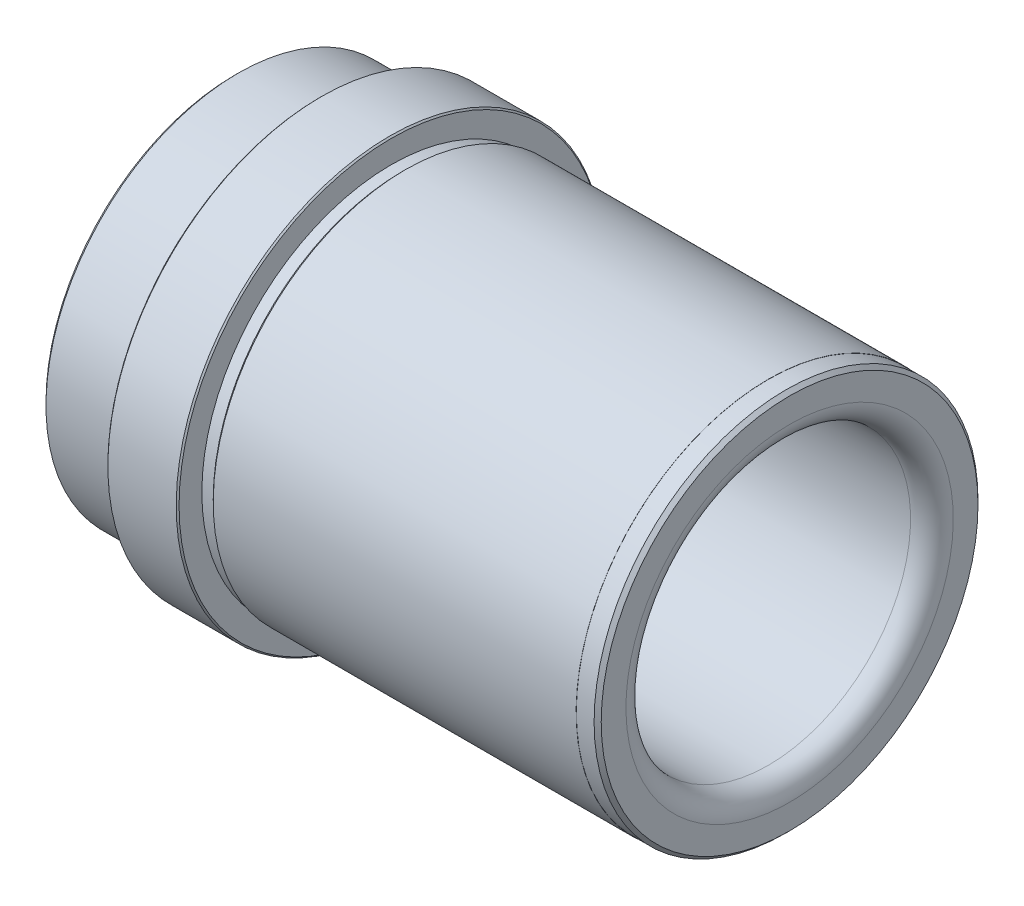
ISO-10303-21;
HEADER;
FILE_DESCRIPTION(('STEP AP214'),'2;1');
FILE_NAME('part.step','',(''),(''),'','','');
FILE_SCHEMA(('AUTOMOTIVE_DESIGN { 1 0 10303 214 1 1 1 1 }'));
ENDSEC;
DATA;
#1=APPLICATION_CONTEXT('core data for automotive mechanical design processes');
#2=APPLICATION_PROTOCOL_DEFINITION('international standard','automotive_design',2000,#1);
#3=PRODUCT_CONTEXT('',#1,'mechanical');
#4=PRODUCT('Part','Part','',(#3));
#5=PRODUCT_RELATED_PRODUCT_CATEGORY('part','',(#4));
#6=PRODUCT_DEFINITION_FORMATION('','',#4);
#7=PRODUCT_DEFINITION_CONTEXT('part definition',#1,'design');
#8=PRODUCT_DEFINITION('design','',#6,#7);
#9=PRODUCT_DEFINITION_SHAPE('','',#8);
#10=(LENGTH_UNIT() NAMED_UNIT(*) SI_UNIT(.MILLI.,.METRE.));
#11=(NAMED_UNIT(*) PLANE_ANGLE_UNIT() SI_UNIT($,.RADIAN.));
#12=(NAMED_UNIT(*) SI_UNIT($,.STERADIAN.) SOLID_ANGLE_UNIT());
#13=UNCERTAINTY_MEASURE_WITH_UNIT(LENGTH_MEASURE(1.E-05),#10,'distance_accuracy_value','');
#14=(GEOMETRIC_REPRESENTATION_CONTEXT(3) GLOBAL_UNCERTAINTY_ASSIGNED_CONTEXT((#13)) GLOBAL_UNIT_ASSIGNED_CONTEXT((#10,
#11,#12)) REPRESENTATION_CONTEXT('',''));
#15=CARTESIAN_POINT('',(0.,0.,0.));
#16=DIRECTION('',(0.,0.,1.));
#17=DIRECTION('',(1.,0.,0.));
#18=AXIS2_PLACEMENT_3D('',#15,#16,#17);
#19=CARTESIAN_POINT('',(39.,0.,0.));
#20=DIRECTION('',(1.,0.,0.));
#21=DIRECTION('',(0.,1.,0.));
#22=AXIS2_PLACEMENT_3D('',#19,#20,#21);
#23=CYLINDRICAL_SURFACE('',#22,26.6);
#24=CARTESIAN_POINT('',(-17.,0.,0.));
#25=DIRECTION('',(1.,0.,0.));
#26=DIRECTION('',(0.,1.,0.));
#27=AXIS2_PLACEMENT_3D('',#24,#25,#26);
#28=CIRCLE('',#27,26.6);
#29=CARTESIAN_POINT('',(-17.,26.6,0.));
#30=VERTEX_POINT('',#29);
#31=EDGE_CURVE('E73',#30,#30,#28,.T.);
#32=ORIENTED_EDGE('',*,*,#31,.T.);
#33=EDGE_LOOP('',(#32));
#34=FACE_BOUND('',#33,.T.);
#35=CARTESIAN_POINT('',(-15.4,0.,0.));
#36=DIRECTION('',(1.,0.,0.));
#37=DIRECTION('',(0.,1.,0.));
#38=AXIS2_PLACEMENT_3D('',#35,#36,#37);
#39=CIRCLE('',#38,26.6);
#40=CARTESIAN_POINT('',(-15.4,26.6,0.));
#41=VERTEX_POINT('',#40);
#42=EDGE_CURVE('E94',#41,#41,#39,.T.);
#43=ORIENTED_EDGE('',*,*,#42,.F.);
#44=EDGE_LOOP('',(#43));
#45=FACE_BOUND('',#44,.T.);
#46=ADVANCED_FACE('F29',(#34,#45),#23,.T.);
#47=CARTESIAN_POINT('',(-17.,30.,0.));
#48=DIRECTION('',(1.,0.,0.));
#49=DIRECTION('',(0.,1.,0.));
#50=AXIS2_PLACEMENT_3D('',#47,#48,#49);
#51=PLANE('',#50);
#52=CARTESIAN_POINT('',(-17.,0.,0.));
#53=DIRECTION('',(1.,0.,0.));
#54=DIRECTION('',(0.,1.,0.));
#55=AXIS2_PLACEMENT_3D('',#52,#53,#54);
#56=CIRCLE('',#55,29.8);
#57=CARTESIAN_POINT('',(-17.,29.8,0.));
#58=VERTEX_POINT('',#57);
#59=EDGE_CURVE('E49',#58,#58,#56,.T.);
#60=ORIENTED_EDGE('',*,*,#59,.T.);
#61=EDGE_LOOP('',(#60));
#62=FACE_BOUND('',#61,.T.);
#63=ORIENTED_EDGE('',*,*,#31,.F.);
#64=EDGE_LOOP('',(#63));
#65=FACE_BOUND('',#64,.T.);
#66=ADVANCED_FACE('F102',(#62,#65),#51,.T.);
#67=CARTESIAN_POINT('',(39.,0.,0.));
#68=DIRECTION('',(1.,0.,0.));
#69=DIRECTION('',(0.,1.,0.));
#70=AXIS2_PLACEMENT_3D('',#67,#68,#69);
#71=CYLINDRICAL_SURFACE('',#70,30.);
#72=CARTESIAN_POINT('',(-26.8,0.,0.));
#73=DIRECTION('',(-1.,0.,0.));
#74=DIRECTION('',(0.,-1.,0.));
#75=AXIS2_PLACEMENT_3D('',#72,#73,#74);
#76=CIRCLE('',#75,30.);
#77=CARTESIAN_POINT('',(-26.8,-30.,0.));
#78=VERTEX_POINT('',#77);
#79=EDGE_CURVE('E55',#78,#78,#76,.F.);
#80=ORIENTED_EDGE('',*,*,#79,.T.);
#81=EDGE_LOOP('',(#80));
#82=FACE_BOUND('',#81,.T.);
#83=CARTESIAN_POINT('',(-17.2,0.,0.));
#84=DIRECTION('',(1.,0.,0.));
#85=DIRECTION('',(0.,1.,0.));
#86=AXIS2_PLACEMENT_3D('',#83,#84,#85);
#87=CIRCLE('',#86,30.);
#88=CARTESIAN_POINT('',(-17.2,30.,0.));
#89=VERTEX_POINT('',#88);
#90=EDGE_CURVE('E58',#89,#89,#87,.F.);
#91=ORIENTED_EDGE('',*,*,#90,.T.);
#92=EDGE_LOOP('',(#91));
#93=FACE_BOUND('',#92,.T.);
#94=ADVANCED_FACE('F108',(#82,#93),#71,.T.);
#95=CARTESIAN_POINT('',(-27.,26.6,0.));
#96=DIRECTION('',(-1.,0.,0.));
#97=DIRECTION('',(0.,-1.,0.));
#98=AXIS2_PLACEMENT_3D('',#95,#96,#97);
#99=PLANE('',#98);
#100=CARTESIAN_POINT('',(-27.,0.,0.));
#101=DIRECTION('',(-1.,0.,0.));
#102=DIRECTION('',(0.,-1.,0.));
#103=AXIS2_PLACEMENT_3D('',#100,#101,#102);
#104=CIRCLE('',#103,29.8);
#105=CARTESIAN_POINT('',(-27.,-29.8,0.));
#106=VERTEX_POINT('',#105);
#107=EDGE_CURVE('E52',#106,#106,#104,.T.);
#108=ORIENTED_EDGE('',*,*,#107,.T.);
#109=EDGE_LOOP('',(#108));
#110=FACE_BOUND('',#109,.T.);
#111=CARTESIAN_POINT('',(-27.,0.,0.));
#112=DIRECTION('',(1.,0.,0.));
#113=DIRECTION('',(0.,1.,0.));
#114=AXIS2_PLACEMENT_3D('',#111,#112,#113);
#115=CIRCLE('',#114,26.6);
#116=CARTESIAN_POINT('',(-27.,26.6,0.));
#117=VERTEX_POINT('',#116);
#118=EDGE_CURVE('E76',#117,#117,#115,.T.);
#119=ORIENTED_EDGE('',*,*,#118,.T.);
#120=EDGE_LOOP('',(#119));
#121=FACE_BOUND('',#120,.T.);
#122=ADVANCED_FACE('F178',(#110,#121),#99,.T.);
#123=CARTESIAN_POINT('',(39.,0.,0.));
#124=DIRECTION('',(1.,0.,0.));
#125=DIRECTION('',(0.,1.,0.));
#126=AXIS2_PLACEMENT_3D('',#123,#124,#125);
#127=CYLINDRICAL_SURFACE('',#126,26.6);
#128=CARTESIAN_POINT('',(-28.6,0.,0.));
#129=DIRECTION('',(1.,0.,0.));
#130=DIRECTION('',(0.,1.,0.));
#131=AXIS2_PLACEMENT_3D('',#128,#129,#130);
#132=CIRCLE('',#131,26.6);
#133=CARTESIAN_POINT('',(-28.6,26.6,0.));
#134=VERTEX_POINT('',#133);
#135=EDGE_CURVE('E79',#134,#134,#132,.T.);
#136=ORIENTED_EDGE('',*,*,#135,.T.);
#137=EDGE_LOOP('',(#136));
#138=FACE_BOUND('',#137,.T.);
#139=ORIENTED_EDGE('',*,*,#118,.F.);
#140=EDGE_LOOP('',(#139));
#141=FACE_BOUND('',#140,.T.);
#142=ADVANCED_FACE('F174',(#138,#141),#127,.T.);
#143=CARTESIAN_POINT('',(-28.6,0.,0.));
#144=DIRECTION('',(-1.,0.,0.));
#145=DIRECTION('',(0.,-1.,0.));
#146=AXIS2_PLACEMENT_3D('',#143,#144,#145);
#147=CONICAL_SURFACE('',#146,26.6,0.785398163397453);
#148=CARTESIAN_POINT('',(-29.,0.,0.));
#149=DIRECTION('',(1.,0.,0.));
#150=DIRECTION('',(0.,1.,0.));
#151=AXIS2_PLACEMENT_3D('',#148,#149,#150);
#152=CIRCLE('',#151,27.);
#153=CARTESIAN_POINT('',(-29.,27.,0.));
#154=VERTEX_POINT('',#153);
#155=EDGE_CURVE('E82',#154,#154,#152,.T.);
#156=ORIENTED_EDGE('',*,*,#155,.T.);
#157=EDGE_LOOP('',(#156));
#158=FACE_BOUND('',#157,.T.);
#159=ORIENTED_EDGE('',*,*,#135,.F.);
#160=EDGE_LOOP('',(#159));
#161=FACE_BOUND('',#160,.T.);
#162=ADVANCED_FACE('F171',(#158,#161),#147,.T.);
#163=CARTESIAN_POINT('',(39.,0.,0.));
#164=DIRECTION('',(1.,0.,0.));
#165=DIRECTION('',(0.,1.,0.));
#166=AXIS2_PLACEMENT_3D('',#163,#164,#165);
#167=CYLINDRICAL_SURFACE('',#166,27.);
#168=CARTESIAN_POINT('',(-38.5,0.,0.));
#169=DIRECTION('',(-1.,0.,0.));
#170=DIRECTION('',(0.,-1.,0.));
#171=AXIS2_PLACEMENT_3D('',#168,#169,#170);
#172=CIRCLE('',#171,27.);
#173=CARTESIAN_POINT('',(-38.5,-27.,0.));
#174=VERTEX_POINT('',#173);
#175=EDGE_CURVE('E11',#174,#174,#172,.F.);
#176=ORIENTED_EDGE('',*,*,#175,.T.);
#177=EDGE_LOOP('',(#176));
#178=FACE_BOUND('',#177,.T.);
#179=ORIENTED_EDGE('',*,*,#155,.F.);
#180=EDGE_LOOP('',(#179));
#181=FACE_BOUND('',#180,.T.);
#182=ADVANCED_FACE('F168',(#178,#181),#167,.T.);
#183=CARTESIAN_POINT('',(-39.,27.,0.));
#184=DIRECTION('',(-1.,0.,0.));
#185=DIRECTION('',(0.,-1.,0.));
#186=AXIS2_PLACEMENT_3D('',#183,#184,#185);
#187=PLANE('',#186);
#188=CARTESIAN_POINT('',(-39.,0.,0.));
#189=DIRECTION('',(-1.,0.,0.));
#190=DIRECTION('',(0.,-1.,0.));
#191=AXIS2_PLACEMENT_3D('',#188,#189,#190);
#192=CIRCLE('',#191,20.5000000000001);
#193=CARTESIAN_POINT('',(-39.,-20.5000000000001,0.));
#194=VERTEX_POINT('',#193);
#195=EDGE_CURVE('E36',#194,#194,#192,.F.);
#196=ORIENTED_EDGE('',*,*,#195,.T.);
#197=EDGE_LOOP('',(#196));
#198=FACE_BOUND('',#197,.T.);
#199=CARTESIAN_POINT('',(-39.,0.,0.));
#200=DIRECTION('',(-1.,0.,0.));
#201=DIRECTION('',(0.,-1.,0.));
#202=AXIS2_PLACEMENT_3D('',#199,#200,#201);
#203=CIRCLE('',#202,26.5);
#204=CARTESIAN_POINT('',(-39.,-26.5,0.));
#205=VERTEX_POINT('',#204);
#206=EDGE_CURVE('E40',#205,#205,#203,.T.);
#207=ORIENTED_EDGE('',*,*,#206,.T.);
#208=EDGE_LOOP('',(#207));
#209=FACE_BOUND('',#208,.T.);
#210=ADVANCED_FACE('F164',(#198,#209),#187,.T.);
#211=CARTESIAN_POINT('',(39.,26.975,0.));
#212=DIRECTION('',(1.,0.,0.));
#213=DIRECTION('',(0.,1.,0.));
#214=AXIS2_PLACEMENT_3D('',#211,#212,#213);
#215=PLANE('',#214);
#216=CARTESIAN_POINT('',(39.,0.,0.));
#217=DIRECTION('',(1.,0.,0.));
#218=DIRECTION('',(0.,1.,0.));
#219=AXIS2_PLACEMENT_3D('',#216,#217,#218);
#220=CIRCLE('',#219,26.475);
#221=CARTESIAN_POINT('',(39.,26.475,0.));
#222=VERTEX_POINT('',#221);
#223=EDGE_CURVE('E64',#222,#222,#220,.T.);
#224=ORIENTED_EDGE('',*,*,#223,.T.);
#225=EDGE_LOOP('',(#224));
#226=FACE_BOUND('',#225,.T.);
#227=CARTESIAN_POINT('',(39.,0.,0.));
#228=DIRECTION('',(1.,0.,0.));
#229=DIRECTION('',(0.,1.,0.));
#230=AXIS2_PLACEMENT_3D('',#227,#228,#229);
#231=CIRCLE('',#230,23.);
#232=CARTESIAN_POINT('',(39.,23.,0.));
#233=VERTEX_POINT('',#232);
#234=EDGE_CURVE('E67',#233,#233,#231,.F.);
#235=ORIENTED_EDGE('',*,*,#234,.T.);
#236=EDGE_LOOP('',(#235));
#237=FACE_BOUND('',#236,.T.);
#238=ADVANCED_FACE('F160',(#226,#237),#215,.T.);
#239=CARTESIAN_POINT('',(39.,0.,0.));
#240=DIRECTION('',(1.,0.,0.));
#241=DIRECTION('',(0.,1.,0.));
#242=AXIS2_PLACEMENT_3D('',#239,#240,#241);
#243=CYLINDRICAL_SURFACE('',#242,26.975);
#244=CARTESIAN_POINT('',(38.5,0.,0.));
#245=DIRECTION('',(1.,0.,0.));
#246=DIRECTION('',(0.,1.,0.));
#247=AXIS2_PLACEMENT_3D('',#244,#245,#246);
#248=CIRCLE('',#247,26.975);
#249=CARTESIAN_POINT('',(38.5,26.975,0.));
#250=VERTEX_POINT('',#249);
#251=EDGE_CURVE('E61',#250,#250,#248,.F.);
#252=ORIENTED_EDGE('',*,*,#251,.T.);
#253=EDGE_LOOP('',(#252));
#254=FACE_BOUND('',#253,.T.);
#255=CARTESIAN_POINT('',(36.,0.,0.));
#256=DIRECTION('',(1.,0.,0.));
#257=DIRECTION('',(0.,1.,0.));
#258=AXIS2_PLACEMENT_3D('',#255,#256,#257);
#259=CIRCLE('',#258,26.975);
#260=CARTESIAN_POINT('',(36.,26.975,0.));
#261=VERTEX_POINT('',#260);
#262=EDGE_CURVE('E85',#261,#261,#259,.T.);
#263=ORIENTED_EDGE('',*,*,#262,.T.);
#264=EDGE_LOOP('',(#263));
#265=FACE_BOUND('',#264,.T.);
#266=ADVANCED_FACE('F156',(#254,#265),#243,.T.);
#267=CARTESIAN_POINT('',(36.,26.975,0.));
#268=DIRECTION('',(1.,0.,0.));
#269=DIRECTION('',(0.,1.,0.));
#270=AXIS2_PLACEMENT_3D('',#267,#268,#269);
#271=PLANE('',#270);
#272=CARTESIAN_POINT('',(36.,0.,0.));
#273=DIRECTION('',(1.,0.,0.));
#274=DIRECTION('',(0.,1.,0.));
#275=AXIS2_PLACEMENT_3D('',#272,#273,#274);
#276=CIRCLE('',#275,27.);
#277=CARTESIAN_POINT('',(36.,27.,0.));
#278=VERTEX_POINT('',#277);
#279=EDGE_CURVE('E88',#278,#278,#276,.T.);
#280=ORIENTED_EDGE('',*,*,#279,.T.);
#281=EDGE_LOOP('',(#280));
#282=FACE_BOUND('',#281,.T.);
#283=ORIENTED_EDGE('',*,*,#262,.F.);
#284=EDGE_LOOP('',(#283));
#285=FACE_BOUND('',#284,.T.);
#286=ADVANCED_FACE('F152',(#282,#285),#271,.T.);
#287=CARTESIAN_POINT('',(39.,0.,0.));
#288=DIRECTION('',(1.,0.,0.));
#289=DIRECTION('',(0.,1.,0.));
#290=AXIS2_PLACEMENT_3D('',#287,#288,#289);
#291=CYLINDRICAL_SURFACE('',#290,27.);
#292=CARTESIAN_POINT('',(-15.,0.,0.));
#293=DIRECTION('',(1.,0.,0.));
#294=DIRECTION('',(0.,1.,0.));
#295=AXIS2_PLACEMENT_3D('',#292,#293,#294);
#296=CIRCLE('',#295,27.);
#297=CARTESIAN_POINT('',(-15.,27.,0.));
#298=VERTEX_POINT('',#297);
#299=EDGE_CURVE('E91',#298,#298,#296,.T.);
#300=ORIENTED_EDGE('',*,*,#299,.T.);
#301=EDGE_LOOP('',(#300));
#302=FACE_BOUND('',#301,.T.);
#303=ORIENTED_EDGE('',*,*,#279,.F.);
#304=EDGE_LOOP('',(#303));
#305=FACE_BOUND('',#304,.T.);
#306=ADVANCED_FACE('F147',(#302,#305),#291,.T.);
#307=CARTESIAN_POINT('',(-15.,0.,0.));
#308=DIRECTION('',(1.,0.,0.));
#309=DIRECTION('',(0.,1.,0.));
#310=AXIS2_PLACEMENT_3D('',#307,#308,#309);
#311=CONICAL_SURFACE('',#310,27.,0.785398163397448);
#312=ORIENTED_EDGE('',*,*,#42,.T.);
#313=EDGE_LOOP('',(#312));
#314=FACE_BOUND('',#313,.T.);
#315=ORIENTED_EDGE('',*,*,#299,.F.);
#316=EDGE_LOOP('',(#315));
#317=FACE_BOUND('',#316,.T.);
#318=ADVANCED_FACE('F98',(#314,#317),#311,.T.);
#319=CARTESIAN_POINT('',(-77.,0.,0.));
#320=DIRECTION('',(1.,0.,0.));
#321=DIRECTION('',(0.,1.,0.));
#322=AXIS2_PLACEMENT_3D('',#319,#320,#321);
#323=CYLINDRICAL_SURFACE('',#322,20.);
#324=CARTESIAN_POINT('',(-38.4999999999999,0.,0.));
#325=DIRECTION('',(-1.,0.,0.));
#326=DIRECTION('',(0.,-1.,0.));
#327=AXIS2_PLACEMENT_3D('',#324,#325,#326);
#328=CIRCLE('',#327,20.);
#329=CARTESIAN_POINT('',(-38.4999999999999,20.,0.));
#330=VERTEX_POINT('',#329);
#331=EDGE_CURVE('E44',#330,#330,#328,.T.);
#332=CARTESIAN_POINT('',(36.,0.,0.));
#333=DIRECTION('',(1.,0.,0.));
#334=DIRECTION('',(0.,1.,0.));
#335=AXIS2_PLACEMENT_3D('',#332,#333,#334);
#336=CIRCLE('',#335,20.);
#337=CARTESIAN_POINT('',(36.,20.,0.));
#338=VERTEX_POINT('',#337);
#339=EDGE_CURVE('E70',#338,#338,#336,.T.);
#340=CARTESIAN_POINT('',(-38.4999999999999,20.,0.));
#341=CARTESIAN_POINT('',(-37.7239583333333,20.,0.));
#342=CARTESIAN_POINT('',(-36.9479166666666,20.,0.));
#343=CARTESIAN_POINT('',(-35.3958333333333,20.,0.));
#344=CARTESIAN_POINT('',(-34.6197916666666,20.,0.));
#345=CARTESIAN_POINT('',(-33.0677083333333,20.,0.));
#346=CARTESIAN_POINT('',(-32.2916666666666,20.,0.));
#347=CARTESIAN_POINT('',(-30.7395833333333,20.,0.));
#348=CARTESIAN_POINT('',(-29.9635416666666,20.,0.));
#349=CARTESIAN_POINT('',(-28.4114583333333,20.,0.));
#350=CARTESIAN_POINT('',(-27.6354166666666,20.,0.));
#351=CARTESIAN_POINT('',(-26.0833333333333,20.,0.));
#352=CARTESIAN_POINT('',(-25.3072916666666,20.,0.));
#353=CARTESIAN_POINT('',(-23.7552083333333,20.,0.));
#354=CARTESIAN_POINT('',(-22.9791666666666,20.,0.));
#355=CARTESIAN_POINT('',(-21.4270833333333,20.,0.));
#356=CARTESIAN_POINT('',(-20.6510416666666,20.,0.));
#357=CARTESIAN_POINT('',(-19.0989583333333,20.,0.));
#358=CARTESIAN_POINT('',(-18.3229166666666,20.,0.));
#359=CARTESIAN_POINT('',(-16.7708333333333,20.,0.));
#360=CARTESIAN_POINT('',(-15.9947916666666,20.,0.));
#361=CARTESIAN_POINT('',(-14.4427083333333,20.,0.));
#362=CARTESIAN_POINT('',(-13.6666666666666,20.,0.));
#363=CARTESIAN_POINT('',(-12.1145833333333,20.,0.));
#364=CARTESIAN_POINT('',(-11.3385416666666,20.,0.));
#365=CARTESIAN_POINT('',(-9.7864583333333,20.,0.));
#366=CARTESIAN_POINT('',(-9.01041666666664,20.,0.));
#367=CARTESIAN_POINT('',(-7.4583333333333,20.,0.));
#368=CARTESIAN_POINT('',(-6.68229166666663,20.,0.));
#369=CARTESIAN_POINT('',(-5.1302083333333,20.,0.));
#370=CARTESIAN_POINT('',(-4.35416666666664,20.,0.));
#371=CARTESIAN_POINT('',(-2.80208333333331,20.,0.));
#372=CARTESIAN_POINT('',(-2.02604166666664,20.,0.));
#373=CARTESIAN_POINT('',(-0.473958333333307,20.,0.));
#374=CARTESIAN_POINT('',(0.30208333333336,20.,0.));
#375=CARTESIAN_POINT('',(1.85416666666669,20.,0.));
#376=CARTESIAN_POINT('',(2.63020833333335,20.,0.));
#377=CARTESIAN_POINT('',(4.18229166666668,20.,0.));
#378=CARTESIAN_POINT('',(4.95833333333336,20.,0.));
#379=CARTESIAN_POINT('',(6.51041666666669,20.,0.));
#380=CARTESIAN_POINT('',(7.28645833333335,20.,0.));
#381=CARTESIAN_POINT('',(8.83854166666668,20.,0.));
#382=CARTESIAN_POINT('',(9.61458333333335,20.,0.));
#383=CARTESIAN_POINT('',(11.1666666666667,20.,0.));
#384=CARTESIAN_POINT('',(11.9427083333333,20.,0.));
#385=CARTESIAN_POINT('',(13.4947916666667,20.,0.));
#386=CARTESIAN_POINT('',(14.2708333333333,20.,0.));
#387=CARTESIAN_POINT('',(15.8229166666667,20.,0.));
#388=CARTESIAN_POINT('',(16.5989583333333,20.,0.));
#389=CARTESIAN_POINT('',(18.1510416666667,20.,0.));
#390=CARTESIAN_POINT('',(18.9270833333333,20.,0.));
#391=CARTESIAN_POINT('',(20.4791666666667,20.,0.));
#392=CARTESIAN_POINT('',(21.2552083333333,20.,0.));
#393=CARTESIAN_POINT('',(22.8072916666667,20.,0.));
#394=CARTESIAN_POINT('',(23.5833333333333,20.,0.));
#395=CARTESIAN_POINT('',(25.1354166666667,20.,0.));
#396=CARTESIAN_POINT('',(25.9114583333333,20.,0.));
#397=CARTESIAN_POINT('',(27.4635416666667,20.,0.));
#398=CARTESIAN_POINT('',(28.2395833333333,20.,0.));
#399=CARTESIAN_POINT('',(29.7916666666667,20.,0.));
#400=CARTESIAN_POINT('',(30.5677083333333,20.,0.));
#401=CARTESIAN_POINT('',(32.1197916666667,20.,0.));
#402=CARTESIAN_POINT('',(32.8958333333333,20.,0.));
#403=CARTESIAN_POINT('',(34.4479166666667,20.,0.));
#404=CARTESIAN_POINT('',(35.2239583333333,20.,0.));
#405=CARTESIAN_POINT('',(36.,20.,0.));
#406=B_SPLINE_CURVE_WITH_KNOTS('',3,(#340,#341,#342,#343,#344,#345,#346,#347,#348,#349,#350,
#351,#352,#353,#354,#355,#356,#357,#358,#359,#360,#361,#362,#363,#364,#365,#366,#367,#368,#369,
#370,#371,#372,#373,#374,#375,#376,#377,#378,#379,#380,#381,#382,#383,#384,#385,#386,#387,#388,
#389,#390,#391,#392,#393,#394,#395,#396,#397,#398,#399,#400,#401,#402,#403,#404,#405),
.UNSPECIFIED.,.F.,.F.,(4,2,2,2,2,2,2,2,2,2,2,2,2,2,2,2,2,2,2,2,2,2,2,2,2,2,2,2,2,2,2,2,4),(0.,
2.328125,4.65624999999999,6.98437499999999,9.31249999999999,11.640625,13.96875,16.296875,18.625,
20.953125,23.28125,25.609375,27.9375,30.265625,32.59375,34.921875,37.25,39.578125,
41.9062499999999,44.234375,46.5624999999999,48.8906249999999,51.2187499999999,53.5468749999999,
55.8749999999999,58.2031249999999,60.5312499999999,62.8593749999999,65.1874999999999,
67.5156249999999,69.8437499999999,72.1718749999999,74.4999999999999),.UNSPECIFIED.);
#407=EDGE_CURVE('BSEAM117',#330,#338,#406,.T.);
#408=ORIENTED_EDGE('',*,*,#331,.T.);
#409=ORIENTED_EDGE('',*,*,#339,.T.);
#410=ORIENTED_EDGE('',*,*,#407,.T.);
#411=ORIENTED_EDGE('',*,*,#407,.F.);
#412=EDGE_LOOP('',(#408,#410,#409,#411));
#413=FACE_BOUND('',#412,.T.);
#414=ADVANCED_FACE('F117',(#413),#323,.F.);
#415=CARTESIAN_POINT('',(36.,0.,0.));
#416=DIRECTION('',(1.,0.,0.));
#417=DIRECTION('',(0.,1.,0.));
#418=AXIS2_PLACEMENT_3D('',#415,#416,#417);
#419=TOROIDAL_SURFACE('',#418,23.,3.);
#420=ORIENTED_EDGE('',*,*,#234,.F.);
#421=EDGE_LOOP('',(#420));
#422=FACE_BOUND('',#421,.T.);
#423=ORIENTED_EDGE('',*,*,#339,.F.);
#424=EDGE_LOOP('',(#423));
#425=FACE_BOUND('',#424,.T.);
#426=ADVANCED_FACE('F113',(#422,#425),#419,.T.);
#427=CARTESIAN_POINT('',(39.,0.,0.));
#428=DIRECTION('',(-1.,0.,0.));
#429=DIRECTION('',(0.,-1.,0.));
#430=AXIS2_PLACEMENT_3D('',#427,#428,#429);
#431=CONICAL_SURFACE('',#430,26.475,0.785398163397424);
#432=ORIENTED_EDGE('',*,*,#251,.F.);
#433=EDGE_LOOP('',(#432));
#434=FACE_BOUND('',#433,.T.);
#435=ORIENTED_EDGE('',*,*,#223,.F.);
#436=EDGE_LOOP('',(#435));
#437=FACE_BOUND('',#436,.T.);
#438=ADVANCED_FACE('F116',(#434,#437),#431,.T.);
#439=CARTESIAN_POINT('',(-26.8,0.,0.));
#440=DIRECTION('',(1.,0.,0.));
#441=DIRECTION('',(0.,1.,0.));
#442=AXIS2_PLACEMENT_3D('',#439,#440,#441);
#443=CONICAL_SURFACE('',#442,30.,0.785398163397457);
#444=ORIENTED_EDGE('',*,*,#107,.F.);
#445=EDGE_LOOP('',(#444));
#446=FACE_BOUND('',#445,.T.);
#447=ORIENTED_EDGE('',*,*,#79,.F.);
#448=EDGE_LOOP('',(#447));
#449=FACE_BOUND('',#448,.T.);
#450=ADVANCED_FACE('F121',(#446,#449),#443,.T.);
#451=CARTESIAN_POINT('',(-17.,0.,0.));
#452=DIRECTION('',(-1.,0.,0.));
#453=DIRECTION('',(0.,-1.,0.));
#454=AXIS2_PLACEMENT_3D('',#451,#452,#453);
#455=CONICAL_SURFACE('',#454,29.8,0.785398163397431);
#456=ORIENTED_EDGE('',*,*,#90,.F.);
#457=EDGE_LOOP('',(#456));
#458=FACE_BOUND('',#457,.T.);
#459=ORIENTED_EDGE('',*,*,#59,.F.);
#460=EDGE_LOOP('',(#459));
#461=FACE_BOUND('',#460,.T.);
#462=ADVANCED_FACE('F125',(#458,#461),#455,.T.);
#463=CARTESIAN_POINT('',(-38.4999999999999,0.,0.));
#464=DIRECTION('',(-1.,0.,0.));
#465=DIRECTION('',(0.,-1.,0.));
#466=AXIS2_PLACEMENT_3D('',#463,#464,#465);
#467=CONICAL_SURFACE('',#466,20.,0.785398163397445);
#468=ORIENTED_EDGE('',*,*,#195,.F.);
#469=EDGE_LOOP('',(#468));
#470=FACE_BOUND('',#469,.T.);
#471=ORIENTED_EDGE('',*,*,#331,.F.);
#472=EDGE_LOOP('',(#471));
#473=FACE_BOUND('',#472,.T.);
#474=ADVANCED_FACE('F128',(#470,#473),#467,.F.);
#475=CARTESIAN_POINT('',(-38.5,0.,0.));
#476=DIRECTION('',(1.,0.,0.));
#477=DIRECTION('',(0.,1.,0.));
#478=AXIS2_PLACEMENT_3D('',#475,#476,#477);
#479=CONICAL_SURFACE('',#478,27.,0.785398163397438);
#480=ORIENTED_EDGE('',*,*,#206,.F.);
#481=EDGE_LOOP('',(#480));
#482=FACE_BOUND('',#481,.T.);
#483=ORIENTED_EDGE('',*,*,#175,.F.);
#484=EDGE_LOOP('',(#483));
#485=FACE_BOUND('',#484,.T.);
#486=ADVANCED_FACE('F31',(#482,#485),#479,.T.);
#487=CLOSED_SHELL('',(#46,#66,#94,#122,#142,#162,#182,#210,#238,#266,#286,#306,#318,#414,#426,
#438,#450,#462,#474,#486));
#488=MANIFOLD_SOLID_BREP('B2',#487);
#489=ADVANCED_BREP_SHAPE_REPRESENTATION('',(#18,#488),#14);
#490=SHAPE_DEFINITION_REPRESENTATION(#9,#489);
ENDSEC;
END-ISO-10303-21;
